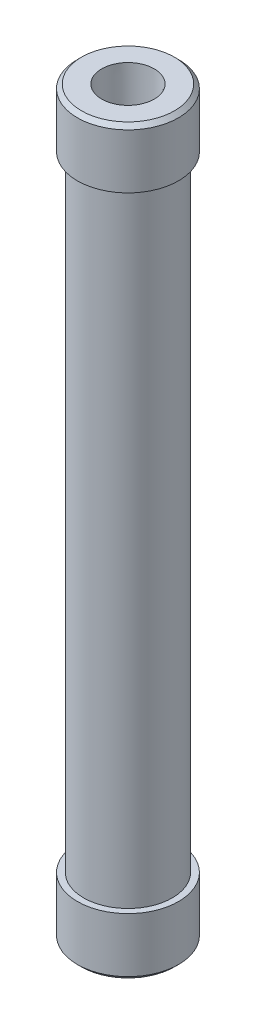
from build123d import *

# Parameters (mm, degrees)
SKETCH1_R           = 16.7005
SKETCH1_R_2         = 13.1445
BOSS_EXTRUDE1_DEPTH = 279.4
SKETCH2_R           = 19.05
BOSS_EXTRUDE2_DEPTH = 22.098
BOSS_EXTRUDE3_START = -22.098
SKETCH3_R           = 19.05
BOSS_EXTRUDE3_DEPTH = 22.098
CHAMFER1_SIZE       = 1.524


with BuildPart() as part:
    # Sketch1 → Boss-Extrude1 (new body)
    with BuildSketch(Plane(origin=(0, 0, 0), x_dir=(1, 0, 0), z_dir=(0, 1, 0))):
        with Locations(Location((0, 0, 0), (0, 0, 270))):
            Circle(SKETCH1_R)
        with Locations(Location((0, 0, 0), (0, 0, 270))):
            Circle(SKETCH1_R_2, mode=Mode.SUBTRACT)
    extrude(amount=BOSS_EXTRUDE1_DEPTH)

    # Sketch2 → Boss-Extrude2 (add)
    with BuildSketch(Plane(origin=(0, 0, 0), x_dir=(1, 0, 0), z_dir=(0, 1, 0))):
        with Locations(Location((0, 0, 0), (0, 0, 270))):
            Circle(SKETCH2_R)
    extrude(amount=BOSS_EXTRUDE2_DEPTH)

    # Sketch3 → Boss-Extrude3 (add)
    with BuildSketch(Plane(origin=(0, 279.4, 0), x_dir=(1, 0, 0), z_dir=(0, 1, 0)).offset(BOSS_EXTRUDE3_START)):
        with Locations(Location((0, 0, 0), (0, 0, 270))):
            Circle(SKETCH3_R)
    extrude(amount=BOSS_EXTRUDE3_DEPTH)

    # Chamfer1
    chamfer1_edges = [part.edges().sort_by_distance(p)[0] for p in [
        (0, 0, -19.05),
        (0, 279.4, -19.05),
    ]]
    chamfer(chamfer1_edges, length=CHAMFER1_SIZE)

    # Sketch5 → 1_2 Rc Tapped Hole1 (revolve, cut)
    with BuildSketch(Plane(origin=(0, 0, 0), x_dir=(0, 0, -1), z_dir=(1, 0, 0))):
        Polygon((0, 0), (0, 29.387530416), (8.75, 24.13), (8.75, 14.986), (9.428250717, 14.986), (9.896063, 0), align=None)
    revolve(axis=Axis((0, -6.35, 0), (0, 1, 0)), mode=Mode.SUBTRACT)

    # Sketch7 → 1_2 Rc Tapped Hole2 (revolve, cut)
    with BuildSketch(Plane(origin=(0, 279.4, 0), x_dir=(0, 0, 1), z_dir=(1, 0, 0))):
        Polygon((0, 0), (0, 29.387530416), (8.75, 24.13), (8.75, 14.986), (9.428250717, 14.986), (9.896063, 0), align=None)
    revolve(axis=Axis((0, 285.75, 0), (0, -1, 0)), mode=Mode.SUBTRACT)


solid = part.part
